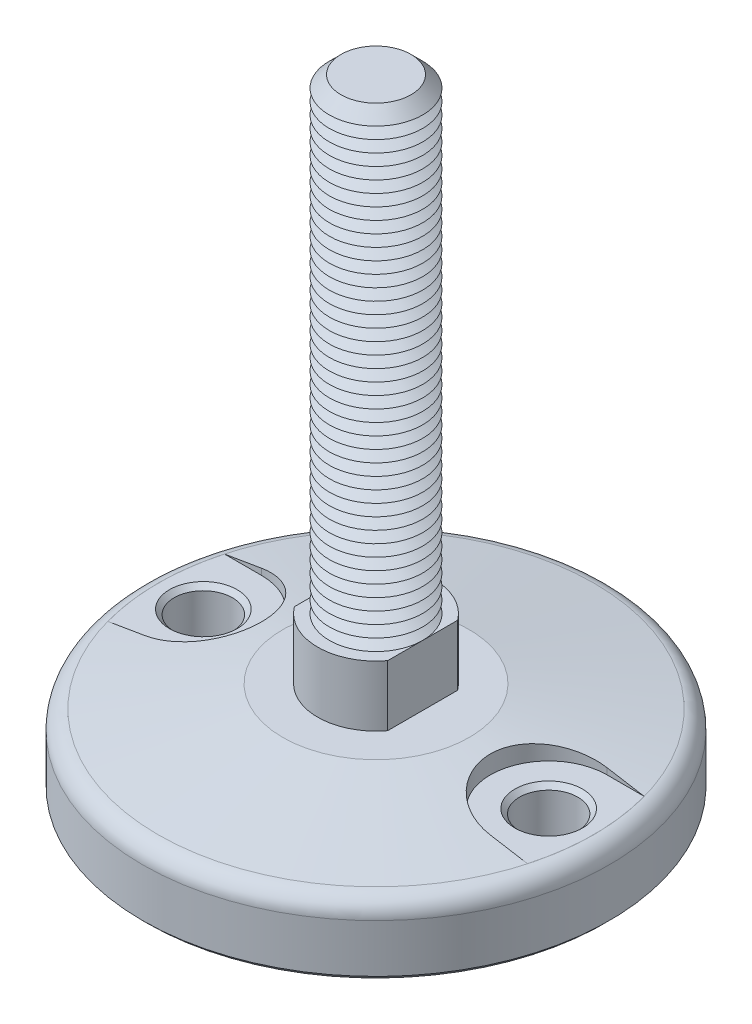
from build123d import *

# Parameters (mm, degrees)
FILLET1_R                = 4
SKETCH3_R                = 12.5
BOSS_EXTRUDE1_DEPTH      = 13
CUT_EXTRUDE1_START       = -13
CUT_EXTRUDE1_DEPTH       = 13
SKETCH5_R                = 10
BOSS_EXTRUDE2_DEPTH      = 100
CHAMFER1_SIZE            = 2.5
LPATTERN1_COUNT          = 39
LPATTERN1_PITCH          = 2.5
CUT_EXTRUDE4_DEPTH       = 4.7
SKETCH10_R               = 6.25
CUT_EXTRUDE5_DEPTH       = 15.3
CHAMFER2_SIZE            = 1
CHAMFER2_OF_MIRROR1_SIZE = 1
CHAMFER3_SIZE            = 1


with BuildPart() as part:
    # Sketch2 → Revolve1 (revolve)
    with BuildSketch(Plane(origin=(0, 0, 0), x_dir=(0, 0, -1), z_dir=(1, 0, 0))):
        Polygon((0, 0), (-20, 0), (-50, -5.289809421), (-50, -20), (0, -20), align=None)
    revolve(axis=Axis((0, 61.338865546, 0), (0, -1, 0)))

    # Fillet1
    fillet1_edges = [part.edges().sort_by_distance(p)[0] for p in [
        (0, -5.289809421, -50),
    ]]
    fillet(fillet1_edges, radius=FILLET1_R)

    # Sketch3 → Boss-Extrude1 (add)
    with BuildSketch(Plane(origin=(0, 0, 0), x_dir=(1, 0, 0), z_dir=(0, 1, 0))):
        with Locations(Location((0, 0, 0), (0, 0, 90))):
            Circle(SKETCH3_R)
    extrude(amount=BOSS_EXTRUDE1_DEPTH)

    # Sketch4 → Cut-Extrude1 (cut)
    with BuildSketch(Plane(origin=(0, 13, 0), x_dir=(1, 0, 0), z_dir=(0, 1, 0)).offset(CUT_EXTRUDE1_START)):
        with BuildLine():
            Line((-10, 7.5), (-10, -7.5))
            ThreePointArc((-10, -7.5), (-12.5, 0), (-10, 7.5))
        make_face()
        with BuildLine():
            Line((10, -7.5), (10, 7.5))
            ThreePointArc((10, 7.5), (12.5, 0), (10, -7.5))
        make_face()
    extrude(amount=CUT_EXTRUDE1_DEPTH, mode=Mode.SUBTRACT)

    # Sketch5 → Boss-Extrude2 (add)
    with BuildSketch(Plane(origin=(0, 13, 0), x_dir=(1, 0, 0), z_dir=(0, 1, 0))):
        with Locations(Location((0, 0, 0), (0, 0, 180))):
            Circle(SKETCH5_R)
    extrude(amount=BOSS_EXTRUDE2_DEPTH)

    # Chamfer1
    chamfer1_edges = [part.edges().sort_by_distance(p)[0] for p in [
        (10, 113, 0),
    ]]
    chamfer(chamfer1_edges, length=CHAMFER1_SIZE)

    # Sketch6 → Cut-Revolve1 (revolve, cut)
    with BuildSketch(Plane(origin=(0, 0, 0), x_dir=(0, 0, -1), z_dir=(1, 0, 0))):
        Polygon((-10, 13), (-7.834936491, 14.25), (-10, 15.5), align=None)
    cut_revolve1 = revolve(axis=Axis((0, 61.338865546, 0), (0, -1, 0)), mode=Mode.SUBTRACT)

    # LPattern1: Cut-Revolve1 ×39
    with Locations(*[(0, i * LPATTERN1_PITCH, 0) for i in range(1, LPATTERN1_COUNT)]):
        add(cut_revolve1, mode=Mode.SUBTRACT)

    # Sketch8 → Cut-Extrude4 (cut)
    with BuildSketch(Plane(origin=(0, 0, 0), x_dir=(1, 0, 0), z_dir=(0, 1, 0))):
        with BuildLine():
            Line((-37, 12.5), (-44.990387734, 12.5))
            ThreePointArc((-44.990387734, 12.5), (-46.694592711, 0), (-44.990387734, -12.5))
            Line((-44.990387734, -12.5), (-37, -12.5))
            ThreePointArc((-37, -12.5), (-24.5, 0), (-37, 12.5))
        make_face()
    cut_extrude4 = extrude(amount=-CUT_EXTRUDE4_DEPTH, mode=Mode.SUBTRACT)

    # Sketch10 → Cut-Extrude5 (cut)
    with BuildSketch(Plane(origin=(0, -4.7, 0), x_dir=(1, 0, 0), z_dir=(0, 1, 0))):
        with Locations(Location((-37, 0, 0), (0, 0, 270))):
            Circle(SKETCH10_R)
    cut_extrude5 = extrude(amount=-CUT_EXTRUDE5_DEPTH, mode=Mode.SUBTRACT)

    # Chamfer2
    chamfer2_edges = [part.edges().sort_by_distance(p)[0] for p in [
        (-37, -4.7, -6.25),
        (-37, -20, -6.25),
    ]]
    chamfer(chamfer2_edges, length=CHAMFER2_SIZE)

    # Mirror1: Cut-Extrude4, Cut-Extrude5 across plane
    add(cut_extrude4.mirror(Plane(origin=(0, 0, 0), x_dir=(0, 0, 1), z_dir=(1, 0, 0))), mode=Mode.SUBTRACT)
    add(cut_extrude5.mirror(Plane(origin=(0, 0, 0), x_dir=(0, 0, 1), z_dir=(1, 0, 0))), mode=Mode.SUBTRACT)

    # Chamfer2 of Mirror1
    chamfer2_of_mirror1_edges = [part.edges().sort_by_distance(p)[0] for p in [
        (37, -4.7, -6.25),
        (37, -20, -6.25),
    ]]
    chamfer(chamfer2_of_mirror1_edges, length=CHAMFER2_OF_MIRROR1_SIZE)

    # Chamfer3
    chamfer3_edges = [part.edges().sort_by_distance(p)[0] for p in [
        (0, -20, -50),
    ]]
    chamfer(chamfer3_edges, length=CHAMFER3_SIZE)


solid = part.part
